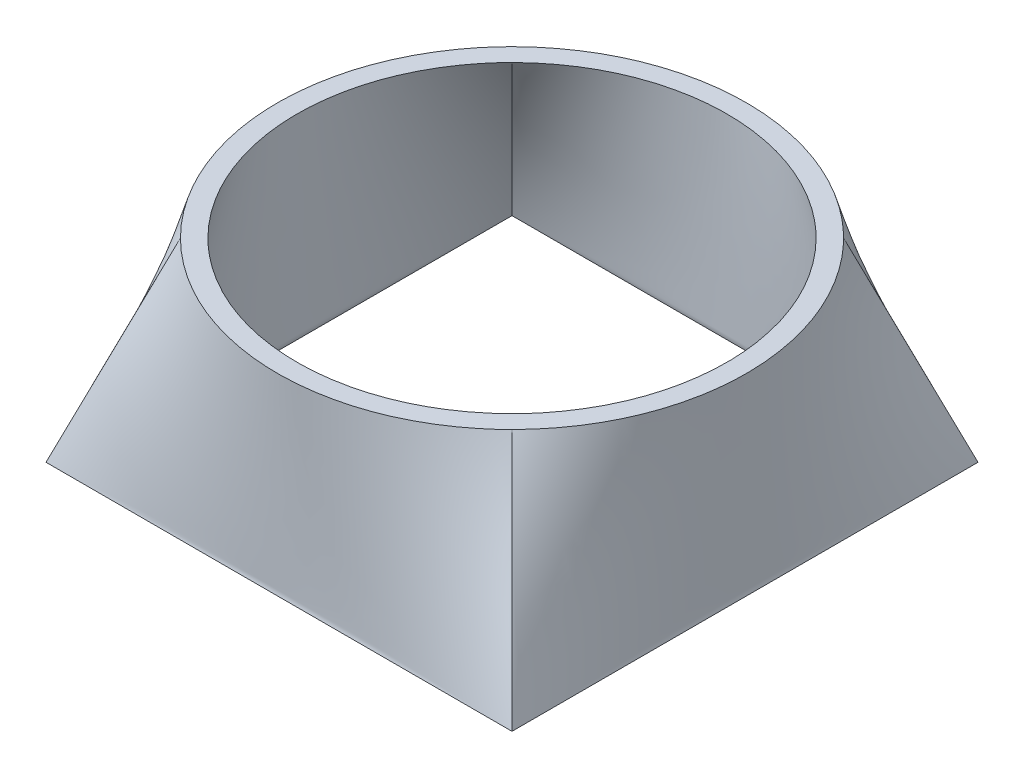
ISO-10303-21;
HEADER;
FILE_DESCRIPTION(('STEP AP214'),'2;1');
FILE_NAME('part.step','',(''),(''),'','','');
FILE_SCHEMA(('AUTOMOTIVE_DESIGN { 1 0 10303 214 1 1 1 1 }'));
ENDSEC;
DATA;
#1=APPLICATION_CONTEXT('core data for automotive mechanical design processes');
#2=APPLICATION_PROTOCOL_DEFINITION('international standard','automotive_design',2000,#1);
#3=PRODUCT_CONTEXT('',#1,'mechanical');
#4=PRODUCT('Part','Part','',(#3));
#5=PRODUCT_RELATED_PRODUCT_CATEGORY('part','',(#4));
#6=PRODUCT_DEFINITION_FORMATION('','',#4);
#7=PRODUCT_DEFINITION_CONTEXT('part definition',#1,'design');
#8=PRODUCT_DEFINITION('design','',#6,#7);
#9=PRODUCT_DEFINITION_SHAPE('','',#8);
#10=(LENGTH_UNIT() NAMED_UNIT(*) SI_UNIT(.MILLI.,.METRE.));
#11=(NAMED_UNIT(*) PLANE_ANGLE_UNIT() SI_UNIT($,.RADIAN.));
#12=(NAMED_UNIT(*) SI_UNIT($,.STERADIAN.) SOLID_ANGLE_UNIT());
#13=UNCERTAINTY_MEASURE_WITH_UNIT(LENGTH_MEASURE(1.E-05),#10,'distance_accuracy_value','');
#14=(GEOMETRIC_REPRESENTATION_CONTEXT(3) GLOBAL_UNCERTAINTY_ASSIGNED_CONTEXT((#13)) GLOBAL_UNIT_ASSIGNED_CONTEXT((#10,
#11,#12)) REPRESENTATION_CONTEXT('',''));
#15=CARTESIAN_POINT('',(0.,0.,0.));
#16=DIRECTION('',(0.,0.,1.));
#17=DIRECTION('',(1.,0.,0.));
#18=AXIS2_PLACEMENT_3D('',#15,#16,#17);
#19=CARTESIAN_POINT('',(24.14936374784,-0.4,25.10710815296));
#20=CARTESIAN_POINT('',(21.56039211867,6.533333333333,22.55723350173));
#21=CARTESIAN_POINT('',(18.97142048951,13.46666666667,20.0073588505));
#22=CARTESIAN_POINT('',(16.38244886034,20.4,17.45748419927));
#23=CARTESIAN_POINT('',(24.14567665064,-0.4,24.78417056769));
#24=CARTESIAN_POINT('',(21.62061470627,6.533333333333,22.28521406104));
#25=CARTESIAN_POINT('',(19.09555276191,13.46666666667,19.78625755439));
#26=CARTESIAN_POINT('',(16.57049081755,20.4,17.28730104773));
#27=CARTESIAN_POINT('',(24.09663015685,-0.4,20.42529096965));
#28=CARTESIAN_POINT('',(22.42170743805,6.533333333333,18.60024749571));
#29=CARTESIAN_POINT('',(20.74678471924,13.46666666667,16.77520402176));
#30=CARTESIAN_POINT('',(19.07186200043,20.4,14.95016054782));
#31=CARTESIAN_POINT('',(24.02214961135,-0.4,12.05034764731));
#32=CARTESIAN_POINT('',(23.63822301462,6.533333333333,11.17765509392));
#33=CARTESIAN_POINT('',(23.25429641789,13.46666666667,10.30496254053));
#34=CARTESIAN_POINT('',(22.87036982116,20.4,9.432269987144));
#35=CARTESIAN_POINT('',(23.98442519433,-0.4,0.));
#36=CARTESIAN_POINT('',(24.25438849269,6.533333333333,0.));
#37=CARTESIAN_POINT('',(24.52435179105,13.46666666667,0.));
#38=CARTESIAN_POINT('',(24.79431508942,20.4,0.));
#39=CARTESIAN_POINT('',(24.02214961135,-0.4,-12.05034764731));
#40=CARTESIAN_POINT('',(23.63822301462,6.533333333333,-11.17765509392));
#41=CARTESIAN_POINT('',(23.25429641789,13.46666666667,-10.30496254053));
#42=CARTESIAN_POINT('',(22.87036982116,20.4,-9.432269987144));
#43=CARTESIAN_POINT('',(24.09663015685,-0.4,-20.42529096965));
#44=CARTESIAN_POINT('',(22.42170743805,6.533333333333,-18.60024749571));
#45=CARTESIAN_POINT('',(20.74678471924,13.46666666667,-16.77520402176));
#46=CARTESIAN_POINT('',(19.07186200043,20.4,-14.95016054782));
#47=CARTESIAN_POINT('',(24.14567665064,-0.4,-24.78417056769));
#48=CARTESIAN_POINT('',(21.62061470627,6.533333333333,-22.28521406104));
#49=CARTESIAN_POINT('',(19.09555276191,13.46666666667,-19.78625755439));
#50=CARTESIAN_POINT('',(16.57049081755,20.4,-17.28730104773));
#51=CARTESIAN_POINT('',(24.14936374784,-0.4,-25.10710815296));
#52=CARTESIAN_POINT('',(21.56039211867,6.533333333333,-22.55723350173));
#53=CARTESIAN_POINT('',(18.97142048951,13.46666666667,-20.0073588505));
#54=CARTESIAN_POINT('',(16.38244886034,20.4,-17.45748419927));
#55=B_SPLINE_SURFACE_WITH_KNOTS('',3,3,((#19,#20,#21,#22),(#23,#24,#25,#26),(#27,#28,#29,#30),
(#31,#32,#33,#34),(#35,#36,#37,#38),(#39,#40,#41,#42),(#43,#44,#45,#46),(#47,#48,#49,#50),(#51,
#52,#53,#54)),.UNSPECIFIED.,.F.,.F.,.F.,(4,1,1,1,1,1,4),(4,4),(-0.02,0.,0.25,0.5,0.75,1.,1.02),
(-0.02,1.02),.UNSPECIFIED.);
#56=DIRECTION('',(-0.310910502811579,0.898147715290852,-0.310910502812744));
#57=VECTOR('',#56,1.);
#58=CARTESIAN_POINT('',(20.5383143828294,10.0000000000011,20.5383143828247));
#59=LINE('',#58,#57);
#60=CARTESIAN_POINT('',(23.9999999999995,5.90962464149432E-13,24.0000000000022));
#61=VERTEX_POINT('',#60);
#62=CARTESIAN_POINT('',(17.0766287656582,20.,17.0766287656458));
#63=VERTEX_POINT('',#62);
#64=EDGE_CURVE('E93',#61,#63,#59,.T.);
#65=DIRECTION('',(0.,0.,1.));
#66=VECTOR('',#65,1.);
#67=CARTESIAN_POINT('',(24.,0.,0.));
#68=LINE('',#67,#66);
#69=CARTESIAN_POINT('',(24.0000000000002,1.01003596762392E-12,-24.0000000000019));
#70=VERTEX_POINT('',#69);
#71=EDGE_CURVE('E117',#61,#70,#68,.F.);
#72=DIRECTION('',(0.310910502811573,-0.898147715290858,-0.310910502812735));
#73=VECTOR('',#72,1.);
#74=CARTESIAN_POINT('',(20.5383143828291,10.0000000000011,-20.5383143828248));
#75=LINE('',#74,#73);
#76=CARTESIAN_POINT('',(17.0766287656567,20.,-17.0766287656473));
#77=VERTEX_POINT('',#76);
#78=EDGE_CURVE('E131',#77,#70,#75,.T.);
#79=CARTESIAN_POINT('',(17.0766287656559,20.,17.0766287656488));
#80=CARTESIAN_POINT('',(17.4138269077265,20.,16.7393676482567));
#81=CARTESIAN_POINT('',(17.7409018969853,20.,16.3920076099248));
#82=CARTESIAN_POINT('',(18.3739003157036,20.,15.6784542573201));
#83=CARTESIAN_POINT('',(18.6798215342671,20.,15.3122589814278));
#84=CARTESIAN_POINT('',(19.2695591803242,20.,14.5624417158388));
#85=CARTESIAN_POINT('',(19.5533738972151,20.,14.1788183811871));
#86=CARTESIAN_POINT('',(20.0975929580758,20.,13.3960648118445));
#87=CARTESIAN_POINT('',(20.3580278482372,20.,12.9969558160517));
#88=CARTESIAN_POINT('',(20.8549710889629,20.,12.1841488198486));
#89=CARTESIAN_POINT('',(21.0914809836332,20.,11.7704517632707));
#90=CARTESIAN_POINT('',(21.5396497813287,20.,10.9298428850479));
#91=CARTESIAN_POINT('',(21.7513112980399,20.,10.5029324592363));
#92=CARTESIAN_POINT('',(22.0919638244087,20.,9.76114390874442));
#93=CARTESIAN_POINT('',(22.2272819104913,20.,9.44915657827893));
#94=CARTESIAN_POINT('',(22.4844541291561,20.,8.81967544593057));
#95=CARTESIAN_POINT('',(22.6063074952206,20.,8.50218133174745));
#96=CARTESIAN_POINT('',(22.9514787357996,20.,7.54240180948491));
#97=CARTESIAN_POINT('',(23.1544735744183,20.,6.8926756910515));
#98=CARTESIAN_POINT('',(23.5051187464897,20.,5.57876595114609));
#99=CARTESIAN_POINT('',(23.6527852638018,20.,4.91458661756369));
#100=CARTESIAN_POINT('',(23.8919733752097,20.,3.57618216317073));
#101=CARTESIAN_POINT('',(23.9834960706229,20.,2.90195723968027));
#102=CARTESIAN_POINT('',(24.1093926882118,20.,1.54885608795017));
#103=CARTESIAN_POINT('',(24.1438235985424,20.,0.869985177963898));
#104=CARTESIAN_POINT('',(24.154648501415,20.,-0.488215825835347));
#105=CARTESIAN_POINT('',(24.1310430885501,20.,-1.16754591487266));
#106=CARTESIAN_POINT('',(24.0266206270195,20.,-2.52191657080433));
#107=CARTESIAN_POINT('',(23.945791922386,20.,-3.19695623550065));
#108=CARTESIAN_POINT('',(23.7279168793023,20.,-4.53789425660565));
#109=CARTESIAN_POINT('',(23.5908688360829,20.,-5.20379233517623));
#110=CARTESIAN_POINT('',(23.2615466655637,20.,-6.52137246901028));
#111=CARTESIAN_POINT('',(23.0693129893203,20.,-7.17306456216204));
#112=CARTESIAN_POINT('',(22.7402965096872,20.,-8.13654416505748));
#113=CARTESIAN_POINT('',(22.6238312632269,20.,-8.45539610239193));
#114=CARTESIAN_POINT('',(22.3774279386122,20.,-9.08785054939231));
#115=CARTESIAN_POINT('',(22.2474898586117,20.,-9.40145305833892));
#116=CARTESIAN_POINT('',(21.8379908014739,20.,-10.3331309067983));
#117=CARTESIAN_POINT('',(21.5385612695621,20.,-10.9426145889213));
#118=CARTESIAN_POINT('',(20.8897779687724,20.,-12.1340309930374));
#119=CARTESIAN_POINT('',(20.5404347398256,20.,-12.7159694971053));
#120=CARTESIAN_POINT('',(19.7175213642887,20.,-13.9652282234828));
#121=CARTESIAN_POINT('',(19.2331744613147,20.,-14.6255267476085));
#122=CARTESIAN_POINT('',(18.4591544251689,20.,-15.575910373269));
#123=CARTESIAN_POINT('',(18.1934390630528,20.,-15.8858192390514));
#124=CARTESIAN_POINT('',(17.6465160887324,20.,-16.4918093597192));
#125=CARTESIAN_POINT('',(17.3653040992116,20.,-16.7878866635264));
#126=CARTESIAN_POINT('',(17.0766287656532,20.,-17.0766287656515));
#127=B_SPLINE_CURVE_WITH_KNOTS('',3,(#79,#80,#81,#82,#83,#84,#85,#86,#87,#88,#89,#90,#91,#92,
#93,#94,#95,#96,#97,#98,#99,#100,#101,#102,#103,#104,#105,#106,#107,#108,#109,#110,#111,#112,
#113,#114,#115,#116,#117,#118,#119,#120,#121,#122,#123,#124,#125,#126),.UNSPECIFIED.,.F.,.F.,(4,
2,2,2,2,2,2,2,2,2,2,2,2,2,2,2,2,2,2,2,2,2,2,4),(0.,1.43050783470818,2.86116495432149,
4.29193266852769,5.72080299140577,7.14958103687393,8.57820866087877,9.59811405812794,
10.6180774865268,12.6575321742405,14.6963898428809,16.7352075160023,18.7719888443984,
20.8087493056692,22.8459247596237,24.8831619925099,26.9189097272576,27.9370132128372,
28.9551168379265,30.9896240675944,33.0237023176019,35.4756808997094,36.6999122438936,
37.9244911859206),.UNSPECIFIED.);
#128=EDGE_CURVE('E96',#63,#77,#127,.T.);
#129=ORIENTED_EDGE('',*,*,#64,.F.);
#130=ORIENTED_EDGE('',*,*,#71,.T.);
#131=ORIENTED_EDGE('',*,*,#78,.F.);
#132=ORIENTED_EDGE('',*,*,#128,.F.);
#133=EDGE_LOOP('',(#129,#130,#131,#132));
#134=FACE_BOUND('',#133,.T.);
#135=ADVANCED_FACE('F16',(#134),#55,.T.);
#136=CARTESIAN_POINT('',(15.02597276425,20.4,-16.01198819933));
#137=CARTESIAN_POINT('',(17.39623038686,13.46666666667,-18.34621443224));
#138=CARTESIAN_POINT('',(19.76648800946,6.533333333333,-20.68044066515));
#139=CARTESIAN_POINT('',(22.13674563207,-0.4,-23.01466689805));
#140=CARTESIAN_POINT('',(15.19844188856,20.4,-15.85589557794));
#141=CARTESIAN_POINT('',(17.51008255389,13.46666666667,-18.14347790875));
#142=CARTESIAN_POINT('',(19.82172321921,6.533333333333,-20.43106023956));
#143=CARTESIAN_POINT('',(22.13336388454,-0.4,-22.71864257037));
#144=CARTESIAN_POINT('',(17.49266017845,20.4,-13.71226236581));
#145=CARTESIAN_POINT('',(19.02456652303,13.46666666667,-15.38251742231));
#146=CARTESIAN_POINT('',(20.55647286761,6.533333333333,-17.05277247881));
#147=CARTESIAN_POINT('',(22.08837921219,-0.4,-18.72302753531));
#148=CARTESIAN_POINT('',(20.97659178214,20.4,-8.651253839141));
#149=CARTESIAN_POINT('',(21.32441679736,13.46666666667,-9.449520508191));
#150=CARTESIAN_POINT('',(21.67224181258,6.533333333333,-10.24778717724));
#151=CARTESIAN_POINT('',(22.0200668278,-0.4,-11.04605384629));
#152=CARTESIAN_POINT('',(22.74120410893,20.4,0.));
#153=CARTESIAN_POINT('',(22.48929160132,13.46666666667,0.));
#154=CARTESIAN_POINT('',(22.23737909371,6.533333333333,0.));
#155=CARTESIAN_POINT('',(21.9854665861,-0.4,0.));
#156=CARTESIAN_POINT('',(20.97659178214,20.4,8.651253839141));
#157=CARTESIAN_POINT('',(21.32441679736,13.46666666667,9.449520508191));
#158=CARTESIAN_POINT('',(21.67224181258,6.533333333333,10.24778717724));
#159=CARTESIAN_POINT('',(22.0200668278,-0.4,11.04605384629));
#160=CARTESIAN_POINT('',(17.49266017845,20.4,13.71226236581));
#161=CARTESIAN_POINT('',(19.02456652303,13.46666666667,15.38251742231));
#162=CARTESIAN_POINT('',(20.55647286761,6.533333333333,17.05277247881));
#163=CARTESIAN_POINT('',(22.08837921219,-0.4,18.72302753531));
#164=CARTESIAN_POINT('',(15.19844188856,20.4,15.85589557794));
#165=CARTESIAN_POINT('',(17.51008255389,13.46666666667,18.14347790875));
#166=CARTESIAN_POINT('',(19.82172321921,6.533333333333,20.43106023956));
#167=CARTESIAN_POINT('',(22.13336388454,-0.4,22.71864257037));
#168=CARTESIAN_POINT('',(15.02597276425,20.4,16.01198819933));
#169=CARTESIAN_POINT('',(17.39623038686,13.46666666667,18.34621443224));
#170=CARTESIAN_POINT('',(19.76648800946,6.533333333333,20.68044066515));
#171=CARTESIAN_POINT('',(22.13674563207,-0.4,23.01466689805));
#172=B_SPLINE_SURFACE_WITH_KNOTS('',3,3,((#136,#137,#138,#139),(#140,#141,#142,#143),(#144,#145,
#146,#147),(#148,#149,#150,#151),(#152,#153,#154,#155),(#156,#157,#158,#159),(#160,#161,#162,
#163),(#164,#165,#166,#167),(#168,#169,#170,#171)),.UNSPECIFIED.,.F.,.F.,.F.,(4,1,1,1,1,1,4),(4,
4),(-0.02,0.,0.25,0.5,0.75,1.,1.02),(-0.02,1.02),.UNSPECIFIED.);
#173=CARTESIAN_POINT('',(15.662415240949,20.,-15.6624151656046));
#174=CARTESIAN_POINT('',(15.9687761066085,20.,-15.3559970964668));
#175=CARTESIAN_POINT('',(16.266026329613,20.,-15.0404898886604));
#176=CARTESIAN_POINT('',(16.8414952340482,20.,-14.3925173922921));
#177=CARTESIAN_POINT('',(17.1197121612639,20.,-14.0600505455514));
#178=CARTESIAN_POINT('',(17.6562665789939,20.,-13.3794116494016));
#179=CARTESIAN_POINT('',(17.9146026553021,20.,-13.0312384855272));
#180=CARTESIAN_POINT('',(18.4102509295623,20.,-12.3208695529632));
#181=CARTESIAN_POINT('',(18.6475884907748,20.,-11.9586914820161));
#182=CARTESIAN_POINT('',(19.100759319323,20.,-11.2211544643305));
#183=CARTESIAN_POINT('',(19.3165938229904,20.,-10.8457962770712));
#184=CARTESIAN_POINT('',(19.725933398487,20.,-10.083122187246));
#185=CARTESIAN_POINT('',(19.9194405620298,20.,-9.69580740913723));
#186=CARTESIAN_POINT('',(20.2324609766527,20.,-9.02017482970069));
#187=CARTESIAN_POINT('',(20.357544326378,20.,-8.73442514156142));
#188=CARTESIAN_POINT('',(20.5953756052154,20.,-8.15783228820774));
#189=CARTESIAN_POINT('',(20.7081228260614,20.,-7.86698883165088));
#190=CARTESIAN_POINT('',(21.0276732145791,20.,-6.98769662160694));
#191=CARTESIAN_POINT('',(21.2158453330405,20.,-6.39235587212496));
#192=CARTESIAN_POINT('',(21.5414571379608,20.,-5.18823382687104));
#193=CARTESIAN_POINT('',(21.6789109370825,20.,-4.57945631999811));
#194=CARTESIAN_POINT('',(21.9023467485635,20.,-3.35251539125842));
#195=CARTESIAN_POINT('',(21.9883296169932,20.,-2.73435212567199));
#196=CARTESIAN_POINT('',(22.1078996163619,20.,-1.49368713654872));
#197=CARTESIAN_POINT('',(22.1415472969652,20.,-0.871191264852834));
#198=CARTESIAN_POINT('',(22.1556323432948,20.,0.374397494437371));
#199=CARTESIAN_POINT('',(22.1360705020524,20.,0.997490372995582));
#200=CARTESIAN_POINT('',(22.0444350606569,20.,2.23990797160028));
#201=CARTESIAN_POINT('',(21.9723513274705,20.,2.85923194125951));
#202=CARTESIAN_POINT('',(21.77659942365,20.,4.08966866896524));
#203=CARTESIAN_POINT('',(21.6529294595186,20.,4.70078114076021));
#204=CARTESIAN_POINT('',(21.3549070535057,20.,5.91015405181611));
#205=CARTESIAN_POINT('',(21.1805904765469,20.,6.50842326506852));
#206=CARTESIAN_POINT('',(20.8817956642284,20.,7.39306315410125));
#207=CARTESIAN_POINT('',(20.7759636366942,20.,7.68584746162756));
#208=CARTESIAN_POINT('',(20.5519368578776,20.,8.26664705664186));
#209=CARTESIAN_POINT('',(20.4337421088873,20.,8.55466234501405));
#210=CARTESIAN_POINT('',(20.0610586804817,20.,9.41040668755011));
#211=CARTESIAN_POINT('',(19.7883091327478,20.,9.97031302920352));
#212=CARTESIAN_POINT('',(19.1969254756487,20.,11.0650037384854));
#213=CARTESIAN_POINT('',(18.8783006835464,20.,11.5997931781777));
#214=CARTESIAN_POINT('',(18.1205986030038,20.,12.7584188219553));
#215=CARTESIAN_POINT('',(17.6705573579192,20.,13.375167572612));
#216=CARTESIAN_POINT('',(16.9504186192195,20.,14.2624140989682));
#217=CARTESIAN_POINT('',(16.7030482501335,20.,14.5516611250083));
#218=CARTESIAN_POINT('',(16.1936177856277,20.,15.1170628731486));
#219=CARTESIAN_POINT('',(15.9315535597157,20.,15.3932138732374));
#220=CARTESIAN_POINT('',(15.662415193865,20.,15.6624152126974));
#221=B_SPLINE_CURVE_WITH_KNOTS('',3,(#173,#174,#175,#176,#177,#178,#179,#180,#181,#182,#183,
#184,#185,#186,#187,#188,#189,#190,#191,#192,#193,#194,#195,#196,#197,#198,#199,#200,#201,#202,
#203,#204,#205,#206,#207,#208,#209,#210,#211,#212,#213,#214,#215,#216,#217,#218,#219,#220),
.UNSPECIFIED.,.F.,.F.,(4,2,2,2,2,2,2,2,2,2,2,2,2,2,2,2,2,2,2,2,2,2,2,4),(0.,1.29968983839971,
2.59949930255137,3.89940114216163,5.19771081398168,6.49594579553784,7.79405905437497,
8.72956362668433,9.66512188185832,11.5358095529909,13.4059763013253,15.2761119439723,
17.1440823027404,19.0120248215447,20.8803278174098,22.7486957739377,24.6157438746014,
25.5494744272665,26.4832048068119,28.3491543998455,30.2147255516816,32.5006556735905,
33.6420256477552,34.7837180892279),.UNSPECIFIED.);
#222=CARTESIAN_POINT('',(15.6624152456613,20.,-15.6624151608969));
#223=VERTEX_POINT('',#222);
#224=CARTESIAN_POINT('',(15.6624151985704,20.,15.662415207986));
#225=VERTEX_POINT('',#224);
#226=EDGE_CURVE('E183',#223,#225,#221,.T.);
#227=DIRECTION('',(0.289170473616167,-0.912557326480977,-0.289170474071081));
#228=VECTOR('',#227,1.);
#229=CARTESIAN_POINT('',(18.8312076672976,10.0000000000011,-18.8312075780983));
#230=LINE('',#229,#228);
#231=CARTESIAN_POINT('',(22.0000000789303,1.67001482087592E-08,-21.9999999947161));
#232=VERTEX_POINT('',#231);
#233=EDGE_CURVE('E123',#223,#232,#230,.T.);
#234=DIRECTION('',(0.,0.,1.));
#235=VECTOR('',#234,1.);
#236=CARTESIAN_POINT('',(22.,0.,0.));
#237=LINE('',#236,#235);
#238=CARTESIAN_POINT('',(22.000000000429,-1.24334859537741E-09,22.0000000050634));
#239=VERTEX_POINT('',#238);
#240=EDGE_CURVE('E128',#232,#239,#237,.T.);
#241=DIRECTION('',(-0.289170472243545,0.912557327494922,-0.289170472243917));
#242=VECTOR('',#241,1.);
#243=CARTESIAN_POINT('',(18.8312076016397,10.0000000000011,18.8312076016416));
#244=LINE('',#243,#242);
#245=EDGE_CURVE('E142',#239,#225,#244,.T.);
#246=ORIENTED_EDGE('',*,*,#226,.F.);
#247=ORIENTED_EDGE('',*,*,#233,.T.);
#248=ORIENTED_EDGE('',*,*,#240,.T.);
#249=ORIENTED_EDGE('',*,*,#245,.T.);
#250=EDGE_LOOP('',(#246,#247,#248,#249));
#251=FACE_BOUND('',#250,.T.);
#252=ADVANCED_FACE('F240',(#251),#172,.F.);
#253=CARTESIAN_POINT('',(16.01198819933,20.4,15.02597276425));
#254=CARTESIAN_POINT('',(18.34621443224,13.46666666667,17.39623038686));
#255=CARTESIAN_POINT('',(20.68044066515,6.533333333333,19.76648800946));
#256=CARTESIAN_POINT('',(23.01466689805,-0.4,22.13674563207));
#257=CARTESIAN_POINT('',(15.85589557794,20.4,15.19844188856));
#258=CARTESIAN_POINT('',(18.14347790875,13.46666666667,17.51008255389));
#259=CARTESIAN_POINT('',(20.43106023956,6.533333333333,19.82172321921));
#260=CARTESIAN_POINT('',(22.71864257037,-0.4,22.13336388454));
#261=CARTESIAN_POINT('',(13.71226236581,20.4,17.49266017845));
#262=CARTESIAN_POINT('',(15.38251742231,13.46666666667,19.02456652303));
#263=CARTESIAN_POINT('',(17.05277247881,6.533333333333,20.55647286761));
#264=CARTESIAN_POINT('',(18.72302753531,-0.4,22.08837921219));
#265=CARTESIAN_POINT('',(8.651253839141,20.4,20.97659178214));
#266=CARTESIAN_POINT('',(9.449520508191,13.46666666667,21.32441679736));
#267=CARTESIAN_POINT('',(10.24778717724,6.533333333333,21.67224181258));
#268=CARTESIAN_POINT('',(11.04605384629,-0.4,22.0200668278));
#269=CARTESIAN_POINT('',(0.,20.4,22.74120410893));
#270=CARTESIAN_POINT('',(0.,13.46666666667,22.48929160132));
#271=CARTESIAN_POINT('',(0.,6.533333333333,22.23737909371));
#272=CARTESIAN_POINT('',(0.,-0.4,21.9854665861));
#273=CARTESIAN_POINT('',(-8.651253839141,20.4,20.97659178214));
#274=CARTESIAN_POINT('',(-9.449520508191,13.46666666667,21.32441679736));
#275=CARTESIAN_POINT('',(-10.24778717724,6.533333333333,21.67224181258));
#276=CARTESIAN_POINT('',(-11.04605384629,-0.4,22.0200668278));
#277=CARTESIAN_POINT('',(-13.71226236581,20.4,17.49266017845));
#278=CARTESIAN_POINT('',(-15.38251742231,13.46666666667,19.02456652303));
#279=CARTESIAN_POINT('',(-17.05277247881,6.533333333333,20.55647286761));
#280=CARTESIAN_POINT('',(-18.72302753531,-0.4,22.08837921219));
#281=CARTESIAN_POINT('',(-15.85589557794,20.4,15.19844188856));
#282=CARTESIAN_POINT('',(-18.14347790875,13.46666666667,17.51008255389));
#283=CARTESIAN_POINT('',(-20.43106023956,6.533333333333,19.82172321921));
#284=CARTESIAN_POINT('',(-22.71864257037,-0.4,22.13336388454));
#285=CARTESIAN_POINT('',(-16.01198819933,20.4,15.02597276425));
#286=CARTESIAN_POINT('',(-18.34621443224,13.46666666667,17.39623038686));
#287=CARTESIAN_POINT('',(-20.68044066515,6.533333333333,19.76648800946));
#288=CARTESIAN_POINT('',(-23.01466689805,-0.4,22.13674563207));
#289=B_SPLINE_SURFACE_WITH_KNOTS('',3,3,((#253,#254,#255,#256),(#257,#258,#259,#260),(#261,#262,
#263,#264),(#265,#266,#267,#268),(#269,#270,#271,#272),(#273,#274,#275,#276),(#277,#278,#279,
#280),(#281,#282,#283,#284),(#285,#286,#287,#288)),.UNSPECIFIED.,.F.,.F.,.F.,(4,1,1,1,1,1,4),(4,
4),(-0.02,0.,0.25,0.5,0.75,1.,1.02),(-0.02,1.02),.UNSPECIFIED.);
#290=CARTESIAN_POINT('',(15.6624151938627,20.,15.6624152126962));
#291=CARTESIAN_POINT('',(15.3559971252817,20.,15.9687760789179));
#292=CARTESIAN_POINT('',(15.0404899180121,20.,16.2660263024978));
#293=CARTESIAN_POINT('',(14.3925174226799,20.,16.8414952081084));
#294=CARTESIAN_POINT('',(14.0600505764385,20.,17.1197121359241));
#295=CARTESIAN_POINT('',(13.3794116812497,20.,17.656266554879));
#296=CARTESIAN_POINT('',(13.0312385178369,20.,17.9146026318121));
#297=CARTESIAN_POINT('',(12.3208695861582,20.,18.4102509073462));
#298=CARTESIAN_POINT('',(11.958691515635,20.,18.6475884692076));
#299=CARTESIAN_POINT('',(11.221154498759,20.,19.1007592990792));
#300=CARTESIAN_POINT('',(10.8457963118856,20.,19.3165938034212));
#301=CARTESIAN_POINT('',(10.0831222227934,20.,19.7259333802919));
#302=CARTESIAN_POINT('',(9.69580744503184,20.,19.9194405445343));
#303=CARTESIAN_POINT('',(9.02017486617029,20.,20.2324609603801));
#304=CARTESIAN_POINT('',(8.73442517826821,20.,20.3575443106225));
#305=CARTESIAN_POINT('',(8.15783232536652,20.,20.5953755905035));
#306=CARTESIAN_POINT('',(7.86698886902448,20.,20.7081228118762));
#307=CARTESIAN_POINT('',(6.98769665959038,20.,21.0276732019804));
#308=CARTESIAN_POINT('',(6.39235591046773,20.,21.2158453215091));
#309=CARTESIAN_POINT('',(5.18823386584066,20.,21.541457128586));
#310=CARTESIAN_POINT('',(4.57945635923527,20.,21.6789109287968));
#311=CARTESIAN_POINT('',(3.35251543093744,20.,21.9023467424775));
#312=CARTESIAN_POINT('',(2.73435216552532,20.,21.9883296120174));
#313=CARTESIAN_POINT('',(1.49368717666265,20.,22.1078996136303));
#314=CARTESIAN_POINT('',(0.871191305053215,20.,22.141547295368));
#315=CARTESIAN_POINT('',(-0.374397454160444,20.,22.1556323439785));
#316=CARTESIAN_POINT('',(-0.997490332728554,20.,22.1360705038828));
#317=CARTESIAN_POINT('',(-2.23990793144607,20.,22.0444350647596));
#318=CARTESIAN_POINT('',(-2.85923190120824,20.,21.9723513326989));
#319=CARTESIAN_POINT('',(-4.08966862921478,20.,21.7765994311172));
#320=CARTESIAN_POINT('',(-4.70078110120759,20.,21.6529294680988));
#321=CARTESIAN_POINT('',(-5.91015401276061,20.,21.3549070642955));
#322=CARTESIAN_POINT('',(-6.50842322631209,20.,21.1805904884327));
#323=CARTESIAN_POINT('',(-7.39306311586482,20.,20.881795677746));
#324=CARTESIAN_POINT('',(-7.68584742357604,20.,20.7759636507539));
#325=CARTESIAN_POINT('',(-8.26664701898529,20.,20.5519368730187));
#326=CARTESIAN_POINT('',(-8.5546623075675,20.,20.4337421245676));
#327=CARTESIAN_POINT('',(-9.41040665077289,20.,20.0610586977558));
#328=CARTESIAN_POINT('',(-9.97031299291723,20.,19.7883091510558));
#329=CARTESIAN_POINT('',(-11.0650037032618,20.,19.1969254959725));
#330=CARTESIAN_POINT('',(-11.5997931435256,20.,18.8783007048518));
#331=CARTESIAN_POINT('',(-12.7584187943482,20.,18.1205986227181));
#332=CARTESIAN_POINT('',(-13.3751675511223,20.,17.6705573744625));
#333=CARTESIAN_POINT('',(-14.2624140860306,20.,16.9504186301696));
#334=CARTESIAN_POINT('',(-14.5516611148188,20.,16.7030482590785));
#335=CARTESIAN_POINT('',(-15.1170628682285,20.,16.1936177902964));
#336=CARTESIAN_POINT('',(-15.3932138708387,20.,15.9315535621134));
#337=CARTESIAN_POINT('',(-15.6624152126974,20.,15.662415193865));
#338=B_SPLINE_CURVE_WITH_KNOTS('',3,(#290,#291,#292,#293,#294,#295,#296,#297,#298,#299,#300,
#301,#302,#303,#304,#305,#306,#307,#308,#309,#310,#311,#312,#313,#314,#315,#316,#317,#318,#319,
#320,#321,#322,#323,#324,#325,#326,#327,#328,#329,#330,#331,#332,#333,#334,#335,#336,#337),
.UNSPECIFIED.,.F.,.F.,(4,2,2,2,2,2,2,2,2,2,2,2,2,2,2,2,2,2,2,2,2,2,2,4),(0.,1.29968983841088,
2.59949930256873,3.89940114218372,5.19771081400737,6.49594579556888,7.79405905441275,
8.72956362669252,9.6651218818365,11.5358095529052,13.4059763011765,15.2761119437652,
17.1440823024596,19.0120248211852,20.8803278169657,22.7486957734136,24.6157438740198,
25.549474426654,26.4832048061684,28.3491543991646,30.2147255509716,32.5006556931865,
33.6420256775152,34.7837181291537),.UNSPECIFIED.);
#339=CARTESIAN_POINT('',(-15.662415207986,20.,15.6624151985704));
#340=VERTEX_POINT('',#339);
#341=EDGE_CURVE('E202',#225,#340,#338,.T.);
#342=DIRECTION('',(1.,0.,0.));
#343=VECTOR('',#342,1.);
#344=CARTESIAN_POINT('',(0.,0.,22.));
#345=LINE('',#344,#343);
#346=CARTESIAN_POINT('',(-22.000000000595,-1.86502289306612E-09,22.0000000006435));
#347=VERTEX_POINT('',#346);
#348=EDGE_CURVE('E151',#239,#347,#345,.F.);
#349=DIRECTION('',(0.289170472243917,0.912557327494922,-0.289170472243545));
#350=VECTOR('',#349,1.);
#351=CARTESIAN_POINT('',(-18.8312076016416,10.0000000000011,18.8312076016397));
#352=LINE('',#351,#350);
#353=EDGE_CURVE('E135',#347,#340,#352,.T.);
#354=ORIENTED_EDGE('',*,*,#341,.F.);
#355=ORIENTED_EDGE('',*,*,#245,.F.);
#356=ORIENTED_EDGE('',*,*,#348,.T.);
#357=ORIENTED_EDGE('',*,*,#353,.T.);
#358=EDGE_LOOP('',(#354,#355,#356,#357));
#359=FACE_BOUND('',#358,.T.);
#360=ADVANCED_FACE('F243',(#359),#289,.F.);
#361=CARTESIAN_POINT('',(-15.02597276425,20.4,16.01198819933));
#362=CARTESIAN_POINT('',(-17.39623038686,13.46666666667,18.34621443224));
#363=CARTESIAN_POINT('',(-19.76648800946,6.533333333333,20.68044066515));
#364=CARTESIAN_POINT('',(-22.13674563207,-0.4,23.01466689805));
#365=CARTESIAN_POINT('',(-15.19844188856,20.4,15.85589557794));
#366=CARTESIAN_POINT('',(-17.51008255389,13.46666666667,18.14347790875));
#367=CARTESIAN_POINT('',(-19.82172321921,6.533333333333,20.43106023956));
#368=CARTESIAN_POINT('',(-22.13336388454,-0.4,22.71864257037));
#369=CARTESIAN_POINT('',(-17.49266017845,20.4,13.71226236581));
#370=CARTESIAN_POINT('',(-19.02456652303,13.46666666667,15.38251742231));
#371=CARTESIAN_POINT('',(-20.55647286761,6.533333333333,17.05277247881));
#372=CARTESIAN_POINT('',(-22.08837921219,-0.4,18.72302753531));
#373=CARTESIAN_POINT('',(-20.97659178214,20.4,8.651253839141));
#374=CARTESIAN_POINT('',(-21.32441679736,13.46666666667,9.449520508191));
#375=CARTESIAN_POINT('',(-21.67224181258,6.533333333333,10.24778717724));
#376=CARTESIAN_POINT('',(-22.0200668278,-0.4,11.04605384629));
#377=CARTESIAN_POINT('',(-22.74120410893,20.4,0.));
#378=CARTESIAN_POINT('',(-22.48929160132,13.46666666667,0.));
#379=CARTESIAN_POINT('',(-22.23737909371,6.533333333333,0.));
#380=CARTESIAN_POINT('',(-21.9854665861,-0.4,0.));
#381=CARTESIAN_POINT('',(-20.97659178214,20.4,-8.651253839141));
#382=CARTESIAN_POINT('',(-21.32441679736,13.46666666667,-9.449520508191));
#383=CARTESIAN_POINT('',(-21.67224181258,6.533333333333,-10.24778717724));
#384=CARTESIAN_POINT('',(-22.0200668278,-0.4,-11.04605384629));
#385=CARTESIAN_POINT('',(-17.49266017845,20.4,-13.71226236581));
#386=CARTESIAN_POINT('',(-19.02456652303,13.46666666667,-15.38251742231));
#387=CARTESIAN_POINT('',(-20.55647286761,6.533333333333,-17.05277247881));
#388=CARTESIAN_POINT('',(-22.08837921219,-0.4,-18.72302753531));
#389=CARTESIAN_POINT('',(-15.19844188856,20.4,-15.85589557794));
#390=CARTESIAN_POINT('',(-17.51008255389,13.46666666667,-18.14347790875));
#391=CARTESIAN_POINT('',(-19.82172321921,6.533333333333,-20.43106023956));
#392=CARTESIAN_POINT('',(-22.13336388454,-0.4,-22.71864257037));
#393=CARTESIAN_POINT('',(-15.02597276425,20.4,-16.01198819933));
#394=CARTESIAN_POINT('',(-17.39623038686,13.46666666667,-18.34621443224));
#395=CARTESIAN_POINT('',(-19.76648800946,6.533333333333,-20.68044066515));
#396=CARTESIAN_POINT('',(-22.13674563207,-0.4,-23.01466689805));
#397=B_SPLINE_SURFACE_WITH_KNOTS('',3,3,((#361,#362,#363,#364),(#365,#366,#367,#368),(#369,#370,
#371,#372),(#373,#374,#375,#376),(#377,#378,#379,#380),(#381,#382,#383,#384),(#385,#386,#387,
#388),(#389,#390,#391,#392),(#393,#394,#395,#396)),.UNSPECIFIED.,.F.,.F.,.F.,(4,1,1,1,1,1,4),(4,
4),(-0.02,0.,0.25,0.5,0.75,1.,1.02),(-0.02,1.02),.UNSPECIFIED.);
#398=CARTESIAN_POINT('',(-15.6624152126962,20.,15.6624151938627));
#399=CARTESIAN_POINT('',(-15.968776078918,20.,15.3559971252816));
#400=CARTESIAN_POINT('',(-16.266026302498,20.,15.0404899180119));
#401=CARTESIAN_POINT('',(-16.8414952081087,20.,14.3925174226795));
#402=CARTESIAN_POINT('',(-17.1197121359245,20.,14.060050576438));
#403=CARTESIAN_POINT('',(-17.6562665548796,20.,13.379411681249));
#404=CARTESIAN_POINT('',(-17.9146026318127,20.,13.0312385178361));
#405=CARTESIAN_POINT('',(-18.4102509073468,20.,12.3208695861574));
#406=CARTESIAN_POINT('',(-18.6475884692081,20.,11.9586915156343));
#407=CARTESIAN_POINT('',(-19.1007592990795,20.,11.2211544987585));
#408=CARTESIAN_POINT('',(-19.3165938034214,20.,10.8457963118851));
#409=CARTESIAN_POINT('',(-19.725933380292,20.,10.0831222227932));
#410=CARTESIAN_POINT('',(-19.9194405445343,20.,9.69580744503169));
#411=CARTESIAN_POINT('',(-20.2324609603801,20.,9.02017486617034));
#412=CARTESIAN_POINT('',(-20.3575443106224,20.,8.73442517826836));
#413=CARTESIAN_POINT('',(-20.5953755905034,20.,8.15783232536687));
#414=CARTESIAN_POINT('',(-20.708122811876,20.,7.86698886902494));
#415=CARTESIAN_POINT('',(-21.0276732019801,20.,6.98769665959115));
#416=CARTESIAN_POINT('',(-21.2158453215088,20.,6.39235591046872));
#417=CARTESIAN_POINT('',(-21.5414571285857,20.,5.18823386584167));
#418=CARTESIAN_POINT('',(-21.6789109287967,20.,4.57945635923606));
#419=CARTESIAN_POINT('',(-21.9023467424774,20.,3.35251543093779));
#420=CARTESIAN_POINT('',(-21.9883296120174,20.,2.73435216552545));
#421=CARTESIAN_POINT('',(-22.1078996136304,20.,1.49368717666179));
#422=CARTESIAN_POINT('',(-22.1415472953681,20.,0.871191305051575));
#423=CARTESIAN_POINT('',(-22.1556323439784,20.,-0.374397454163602));
#424=CARTESIAN_POINT('',(-22.1360705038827,20.,-0.997490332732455));
#425=CARTESIAN_POINT('',(-22.0444350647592,20.,-2.2399079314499));
#426=CARTESIAN_POINT('',(-21.9723513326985,20.,-2.85923190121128));
#427=CARTESIAN_POINT('',(-21.7765994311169,20.,-4.08966862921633));
#428=CARTESIAN_POINT('',(-21.6529294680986,20.,-4.70078110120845));
#429=CARTESIAN_POINT('',(-21.354907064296,20.,-5.91015401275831));
#430=CARTESIAN_POINT('',(-21.180590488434,20.,-6.50842322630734));
#431=CARTESIAN_POINT('',(-20.881795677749,20.,-7.39306311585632));
#432=CARTESIAN_POINT('',(-20.7759636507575,20.,-7.68584742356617));
#433=CARTESIAN_POINT('',(-20.5519368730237,20.,-8.26664701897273));
#434=CARTESIAN_POINT('',(-20.4337421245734,20.,-8.55466230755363));
#435=CARTESIAN_POINT('',(-20.061058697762,20.,-9.4104066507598));
#436=CARTESIAN_POINT('',(-19.7883091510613,20.,-9.97031299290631));
#437=CARTESIAN_POINT('',(-19.1969254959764,20.,-11.0650037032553));
#438=CARTESIAN_POINT('',(-18.8783007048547,20.,-11.5997931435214));
#439=CARTESIAN_POINT('',(-18.1205986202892,20.,-12.758418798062));
#440=CARTESIAN_POINT('',(-17.67055736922,20.,-13.3751675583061));
#441=CARTESIAN_POINT('',(-16.9504186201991,20.,-14.2624140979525));
#442=CARTESIAN_POINT('',(-16.7030482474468,20.,-14.5516611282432));
#443=CARTESIAN_POINT('',(-16.1936177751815,20.,-15.1170628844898));
#444=CARTESIAN_POINT('',(-15.9315535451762,20.,-15.3932138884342));
#445=CARTESIAN_POINT('',(-15.6624151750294,20.,-15.6624152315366));
#446=B_SPLINE_CURVE_WITH_KNOTS('',3,(#398,#399,#400,#401,#402,#403,#404,#405,#406,#407,#408,
#409,#410,#411,#412,#413,#414,#415,#416,#417,#418,#419,#420,#421,#422,#423,#424,#425,#426,#427,
#428,#429,#430,#431,#432,#433,#434,#435,#436,#437,#438,#439,#440,#441,#442,#443,#444,#445),
.UNSPECIFIED.,.F.,.F.,(4,2,2,2,2,2,2,2,2,2,2,2,2,2,2,2,2,2,2,2,2,2,2,4),(0.,1.29968983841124,
2.59949930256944,3.89940114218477,5.19771081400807,6.49594579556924,7.79405905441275,
8.72956362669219,9.66512188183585,11.5358095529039,13.4059763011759,15.2761119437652,
17.144082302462,19.0120248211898,20.8803278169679,22.7486957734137,24.6157438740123,
25.5494744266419,26.4832048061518,28.3491543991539,30.2147255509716,32.5006557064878,
33.6420256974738,34.7837181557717),.UNSPECIFIED.);
#447=CARTESIAN_POINT('',(-15.6624151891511,20.,-15.6624152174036));
#448=VERTEX_POINT('',#447);
#449=EDGE_CURVE('E196',#340,#448,#446,.T.);
#450=DIRECTION('',(0.,0.,1.));
#451=VECTOR('',#450,1.);
#452=CARTESIAN_POINT('',(-22.,0.,0.));
#453=LINE('',#452,#451);
#454=CARTESIAN_POINT('',(-22.0000000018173,-5.56925946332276E-09,-22.0000000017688));
#455=VERTEX_POINT('',#454);
#456=EDGE_CURVE('E108',#347,#455,#453,.F.);
#457=DIRECTION('',(0.289170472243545,0.912557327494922,0.289170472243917));
#458=VECTOR('',#457,1.);
#459=CARTESIAN_POINT('',(-18.8312076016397,10.0000000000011,-18.8312076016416));
#460=LINE('',#459,#458);
#461=EDGE_CURVE('E133',#455,#448,#460,.T.);
#462=ORIENTED_EDGE('',*,*,#449,.F.);
#463=ORIENTED_EDGE('',*,*,#353,.F.);
#464=ORIENTED_EDGE('',*,*,#456,.T.);
#465=ORIENTED_EDGE('',*,*,#461,.T.);
#466=EDGE_LOOP('',(#462,#463,#464,#465));
#467=FACE_BOUND('',#466,.T.);
#468=ADVANCED_FACE('F236',(#467),#397,.F.);
#469=CARTESIAN_POINT('',(-16.01198819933,20.4,-15.02597276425));
#470=CARTESIAN_POINT('',(-18.34621443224,13.46666666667,-17.39623038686));
#471=CARTESIAN_POINT('',(-20.68044066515,6.533333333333,-19.76648800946));
#472=CARTESIAN_POINT('',(-23.01466689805,-0.4,-22.13674563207));
#473=CARTESIAN_POINT('',(-15.85589557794,20.4,-15.19844188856));
#474=CARTESIAN_POINT('',(-18.14347790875,13.46666666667,-17.51008255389));
#475=CARTESIAN_POINT('',(-20.43106023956,6.533333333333,-19.82172321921));
#476=CARTESIAN_POINT('',(-22.71864257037,-0.4,-22.13336388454));
#477=CARTESIAN_POINT('',(-13.71226236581,20.4,-17.49266017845));
#478=CARTESIAN_POINT('',(-15.38251742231,13.46666666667,-19.02456652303));
#479=CARTESIAN_POINT('',(-17.05277247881,6.533333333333,-20.55647286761));
#480=CARTESIAN_POINT('',(-18.72302753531,-0.4,-22.08837921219));
#481=CARTESIAN_POINT('',(-8.651253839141,20.4,-20.97659178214));
#482=CARTESIAN_POINT('',(-9.449520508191,13.46666666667,-21.32441679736));
#483=CARTESIAN_POINT('',(-10.24778717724,6.533333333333,-21.67224181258));
#484=CARTESIAN_POINT('',(-11.04605384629,-0.4,-22.0200668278));
#485=CARTESIAN_POINT('',(0.,20.4,-22.74120410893));
#486=CARTESIAN_POINT('',(0.,13.46666666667,-22.48929160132));
#487=CARTESIAN_POINT('',(0.,6.533333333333,-22.23737909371));
#488=CARTESIAN_POINT('',(0.,-0.4,-21.9854665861));
#489=CARTESIAN_POINT('',(8.651253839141,20.4,-20.97659178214));
#490=CARTESIAN_POINT('',(9.449520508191,13.46666666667,-21.32441679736));
#491=CARTESIAN_POINT('',(10.24778717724,6.533333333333,-21.67224181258));
#492=CARTESIAN_POINT('',(11.04605384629,-0.4,-22.0200668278));
#493=CARTESIAN_POINT('',(13.71226236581,20.4,-17.49266017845));
#494=CARTESIAN_POINT('',(15.38251742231,13.46666666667,-19.02456652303));
#495=CARTESIAN_POINT('',(17.05277247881,6.533333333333,-20.55647286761));
#496=CARTESIAN_POINT('',(18.72302753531,-0.4,-22.08837921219));
#497=CARTESIAN_POINT('',(15.85589557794,20.4,-15.19844188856));
#498=CARTESIAN_POINT('',(18.14347790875,13.46666666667,-17.51008255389));
#499=CARTESIAN_POINT('',(20.43106023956,6.533333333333,-19.82172321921));
#500=CARTESIAN_POINT('',(22.71864257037,-0.4,-22.13336388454));
#501=CARTESIAN_POINT('',(16.01198819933,20.4,-15.02597276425));
#502=CARTESIAN_POINT('',(18.34621443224,13.46666666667,-17.39623038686));
#503=CARTESIAN_POINT('',(20.68044066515,6.533333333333,-19.76648800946));
#504=CARTESIAN_POINT('',(23.01466689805,-0.4,-22.13674563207));
#505=B_SPLINE_SURFACE_WITH_KNOTS('',3,3,((#469,#470,#471,#472),(#473,#474,#475,#476),(#477,#478,
#479,#480),(#481,#482,#483,#484),(#485,#486,#487,#488),(#489,#490,#491,#492),(#493,#494,#495,
#496),(#497,#498,#499,#500),(#501,#502,#503,#504)),.UNSPECIFIED.,.F.,.F.,.F.,(4,1,1,1,1,1,4),(4,
4),(-0.02,0.,0.25,0.5,0.75,1.,1.02),(-0.02,1.02),.UNSPECIFIED.);
#506=CARTESIAN_POINT('',(-15.6624151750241,20.,-15.6624152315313));
#507=CARTESIAN_POINT('',(-15.3559971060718,20.,-15.9687760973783));
#508=CARTESIAN_POINT('',(-15.0404898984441,20.,-16.2660263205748));
#509=CARTESIAN_POINT('',(-14.3925174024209,20.,-16.841495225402));
#510=CARTESIAN_POINT('',(-14.0600505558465,20.,-17.1197121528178));
#511=CARTESIAN_POINT('',(-13.3794116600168,20.,-17.6562665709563));
#512=CARTESIAN_POINT('',(-13.0312384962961,20.,-17.9146026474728));
#513=CARTESIAN_POINT('',(-12.3208695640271,20.,-18.4102509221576));
#514=CARTESIAN_POINT('',(-11.9586914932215,20.,-18.6475884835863));
#515=CARTESIAN_POINT('',(-11.221154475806,20.,-19.1007593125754));
#516=CARTESIAN_POINT('',(-10.8457962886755,20.,-19.3165938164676));
#517=CARTESIAN_POINT('',(-10.083122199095,20.,-19.7259333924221));
#518=CARTESIAN_POINT('',(-9.69580742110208,20.,-19.919440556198));
#519=CARTESIAN_POINT('',(-9.02017484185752,20.,-20.2324609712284));
#520=CARTESIAN_POINT('',(-8.73442515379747,20.,-20.357544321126));
#521=CARTESIAN_POINT('',(-8.15783230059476,20.,-20.5953756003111));
#522=CARTESIAN_POINT('',(-7.86698884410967,20.,-20.7081228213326));
#523=CARTESIAN_POINT('',(-6.98769663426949,20.,-21.0276732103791));
#524=CARTESIAN_POINT('',(-6.39235588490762,20.,-21.2158453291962));
#525=CARTESIAN_POINT('',(-5.18823383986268,20.,-21.5414571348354));
#526=CARTESIAN_POINT('',(-4.57945633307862,20.,-21.6789109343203));
#527=CARTESIAN_POINT('',(-3.35251540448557,20.,-21.9023467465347));
#528=CARTESIAN_POINT('',(-2.73435213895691,20.,-21.9883296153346));
#529=CARTESIAN_POINT('',(-1.49368714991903,20.,-22.1078996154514));
#530=CARTESIAN_POINT('',(-0.871191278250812,20.,-22.141547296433));
#531=CARTESIAN_POINT('',(0.37439748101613,20.,-22.1556323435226));
#532=CARTESIAN_POINT('',(0.997490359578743,20.,-22.1360705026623));
#533=CARTESIAN_POINT('',(2.23990795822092,20.,-22.0444350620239));
#534=CARTESIAN_POINT('',(2.85923192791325,20.,-21.9723513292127));
#535=CARTESIAN_POINT('',(4.08966865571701,20.,-21.7765994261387));
#536=CARTESIAN_POINT('',(4.70078112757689,20.,-21.6529294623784));
#537=CARTESIAN_POINT('',(5.91015403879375,20.,-21.3549070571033));
#538=CARTESIAN_POINT('',(6.5084232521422,20.,-21.180590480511));
#539=CARTESIAN_POINT('',(7.39306314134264,20.,-20.8817956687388));
#540=CARTESIAN_POINT('',(7.68584744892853,20.,-20.7759636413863));
#541=CARTESIAN_POINT('',(8.26664704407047,20.,-20.5519368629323));
#542=CARTESIAN_POINT('',(8.5546623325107,20.,-20.4337421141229));
#543=CARTESIAN_POINT('',(9.41040667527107,20.,-20.0610586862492));
#544=CARTESIAN_POINT('',(9.97031301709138,20.,-19.7883091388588));
#545=CARTESIAN_POINT('',(11.0650037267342,20.,-19.1969254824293));
#546=CARTESIAN_POINT('',(11.5997931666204,20.,-18.8783006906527));
#547=CARTESIAN_POINT('',(12.7584188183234,20.,-18.120598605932));
#548=CARTESIAN_POINT('',(13.3751675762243,20.,-17.6705573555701));
#549=CARTESIAN_POINT('',(14.2624141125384,20.,-16.950418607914));
#550=CARTESIAN_POINT('',(14.5516611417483,20.,-16.7030482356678));
#551=CARTESIAN_POINT('',(15.1170628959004,20.,-16.1936177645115));
#552=CARTESIAN_POINT('',(15.393213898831,20.,-15.9315535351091));
#553=CARTESIAN_POINT('',(15.6624152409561,20.,-15.6624151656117));
#554=B_SPLINE_CURVE_WITH_KNOTS('',3,(#506,#507,#508,#509,#510,#511,#512,#513,#514,#515,#516,
#517,#518,#519,#520,#521,#522,#523,#524,#525,#526,#527,#528,#529,#530,#531,#532,#533,#534,#535,
#536,#537,#538,#539,#540,#541,#542,#543,#544,#545,#546,#547,#548,#549,#550,#551,#552,#553),
.UNSPECIFIED.,.F.,.F.,(4,2,2,2,2,2,2,2,2,2,2,2,2,2,2,2,2,2,2,2,2,2,2,4),(0.,1.29968983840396,
2.59949930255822,3.89940114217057,5.1977108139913,6.49594579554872,7.79405905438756,
8.72956362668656,9.66512188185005,11.5358095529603,13.4059763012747,15.2761119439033,
17.1440823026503,19.0120248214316,20.880327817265,22.748695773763,24.6157438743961,
25.5494744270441,26.4832048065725,28.3491543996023,30.2147255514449,32.5006557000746,
33.6420256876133,34.7837181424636),.UNSPECIFIED.);
#555=EDGE_CURVE('E189',#448,#223,#554,.T.);
#556=DIRECTION('',(1.,0.,0.));
#557=VECTOR('',#556,1.);
#558=CARTESIAN_POINT('',(0.,0.,-22.));
#559=LINE('',#558,#557);
#560=EDGE_CURVE('E105',#455,#232,#559,.T.);
#561=ORIENTED_EDGE('',*,*,#555,.F.);
#562=ORIENTED_EDGE('',*,*,#461,.F.);
#563=ORIENTED_EDGE('',*,*,#560,.T.);
#564=ORIENTED_EDGE('',*,*,#233,.F.);
#565=EDGE_LOOP('',(#561,#562,#563,#564));
#566=FACE_BOUND('',#565,.T.);
#567=ADVANCED_FACE('F238',(#566),#505,.F.);
#568=CARTESIAN_POINT('',(-25.10710815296,-0.4,24.14936374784));
#569=CARTESIAN_POINT('',(-22.55723350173,6.533333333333,21.56039211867));
#570=CARTESIAN_POINT('',(-20.0073588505,13.46666666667,18.97142048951));
#571=CARTESIAN_POINT('',(-17.45748419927,20.4,16.38244886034));
#572=CARTESIAN_POINT('',(-24.78417056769,-0.4,24.14567665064));
#573=CARTESIAN_POINT('',(-22.28521406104,6.533333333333,21.62061470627));
#574=CARTESIAN_POINT('',(-19.78625755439,13.46666666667,19.09555276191));
#575=CARTESIAN_POINT('',(-17.28730104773,20.4,16.57049081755));
#576=CARTESIAN_POINT('',(-20.42529096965,-0.4,24.09663015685));
#577=CARTESIAN_POINT('',(-18.60024749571,6.533333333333,22.42170743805));
#578=CARTESIAN_POINT('',(-16.77520402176,13.46666666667,20.74678471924));
#579=CARTESIAN_POINT('',(-14.95016054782,20.4,19.07186200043));
#580=CARTESIAN_POINT('',(-12.05034764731,-0.4,24.02214961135));
#581=CARTESIAN_POINT('',(-11.17765509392,6.533333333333,23.63822301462));
#582=CARTESIAN_POINT('',(-10.30496254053,13.46666666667,23.25429641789));
#583=CARTESIAN_POINT('',(-9.432269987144,20.4,22.87036982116));
#584=CARTESIAN_POINT('',(0.,-0.4,23.98442519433));
#585=CARTESIAN_POINT('',(0.,6.533333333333,24.25438849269));
#586=CARTESIAN_POINT('',(0.,13.46666666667,24.52435179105));
#587=CARTESIAN_POINT('',(0.,20.4,24.79431508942));
#588=CARTESIAN_POINT('',(12.05034764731,-0.4,24.02214961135));
#589=CARTESIAN_POINT('',(11.17765509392,6.533333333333,23.63822301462));
#590=CARTESIAN_POINT('',(10.30496254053,13.46666666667,23.25429641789));
#591=CARTESIAN_POINT('',(9.432269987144,20.4,22.87036982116));
#592=CARTESIAN_POINT('',(20.42529096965,-0.4,24.09663015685));
#593=CARTESIAN_POINT('',(18.60024749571,6.533333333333,22.42170743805));
#594=CARTESIAN_POINT('',(16.77520402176,13.46666666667,20.74678471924));
#595=CARTESIAN_POINT('',(14.95016054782,20.4,19.07186200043));
#596=CARTESIAN_POINT('',(24.78417056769,-0.4,24.14567665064));
#597=CARTESIAN_POINT('',(22.28521406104,6.533333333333,21.62061470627));
#598=CARTESIAN_POINT('',(19.78625755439,13.46666666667,19.09555276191));
#599=CARTESIAN_POINT('',(17.28730104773,20.4,16.57049081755));
#600=CARTESIAN_POINT('',(25.10710815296,-0.4,24.14936374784));
#601=CARTESIAN_POINT('',(22.55723350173,6.533333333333,21.56039211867));
#602=CARTESIAN_POINT('',(20.0073588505,13.46666666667,18.97142048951));
#603=CARTESIAN_POINT('',(17.45748419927,20.4,16.38244886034));
#604=B_SPLINE_SURFACE_WITH_KNOTS('',3,3,((#568,#569,#570,#571),(#572,#573,#574,#575),(#576,#577,
#578,#579),(#580,#581,#582,#583),(#584,#585,#586,#587),(#588,#589,#590,#591),(#592,#593,#594,
#595),(#596,#597,#598,#599),(#600,#601,#602,#603)),.UNSPECIFIED.,.F.,.F.,.F.,(4,1,1,1,1,1,4),(4,
4),(-0.02,0.,0.25,0.5,0.75,1.,1.02),(-0.02,1.02),.UNSPECIFIED.);
#605=DIRECTION('',(0.310910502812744,0.898147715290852,-0.310910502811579));
#606=VECTOR('',#605,1.);
#607=CARTESIAN_POINT('',(-20.5383143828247,10.0000000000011,20.5383143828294));
#608=LINE('',#607,#606);
#609=CARTESIAN_POINT('',(-24.0000000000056,8.32540778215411E-13,23.9999999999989));
#610=VERTEX_POINT('',#609);
#611=CARTESIAN_POINT('',(-17.0766287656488,20.,17.0766287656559));
#612=VERTEX_POINT('',#611);
#613=EDGE_CURVE('E91',#610,#612,#608,.T.);
#614=DIRECTION('',(1.,0.,0.));
#615=VECTOR('',#614,1.);
#616=CARTESIAN_POINT('',(0.,0.,24.));
#617=LINE('',#616,#615);
#618=EDGE_CURVE('E115',#610,#61,#617,.T.);
#619=CARTESIAN_POINT('',(-17.0766287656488,20.,17.0766287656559));
#620=CARTESIAN_POINT('',(-16.7393676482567,20.,17.4138269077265));
#621=CARTESIAN_POINT('',(-16.3920076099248,20.,17.7409018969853));
#622=CARTESIAN_POINT('',(-15.6784542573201,20.,18.3739003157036));
#623=CARTESIAN_POINT('',(-15.3122589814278,20.,18.6798215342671));
#624=CARTESIAN_POINT('',(-14.5624417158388,20.,19.2695591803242));
#625=CARTESIAN_POINT('',(-14.1788183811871,20.,19.5533738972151));
#626=CARTESIAN_POINT('',(-13.3960648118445,20.,20.0975929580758));
#627=CARTESIAN_POINT('',(-12.9969558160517,20.,20.3580278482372));
#628=CARTESIAN_POINT('',(-12.1841488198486,20.,20.8549710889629));
#629=CARTESIAN_POINT('',(-11.7704517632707,20.,21.0914809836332));
#630=CARTESIAN_POINT('',(-10.929842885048,20.,21.5396497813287));
#631=CARTESIAN_POINT('',(-10.5029324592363,20.,21.7513112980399));
#632=CARTESIAN_POINT('',(-9.76114390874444,20.,22.0919638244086));
#633=CARTESIAN_POINT('',(-9.44915657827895,20.,22.2272819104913));
#634=CARTESIAN_POINT('',(-8.8196754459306,20.,22.4844541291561));
#635=CARTESIAN_POINT('',(-8.50218133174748,20.,22.6063074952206));
#636=CARTESIAN_POINT('',(-7.54240180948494,20.,22.9514787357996));
#637=CARTESIAN_POINT('',(-6.89267569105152,20.,23.1544735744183));
#638=CARTESIAN_POINT('',(-5.57876595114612,20.,23.5051187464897));
#639=CARTESIAN_POINT('',(-4.91458661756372,20.,23.6527852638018));
#640=CARTESIAN_POINT('',(-3.57618216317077,20.,23.8919733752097));
#641=CARTESIAN_POINT('',(-2.9019572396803,20.,23.9834960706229));
#642=CARTESIAN_POINT('',(-1.5488560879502,20.,24.1093926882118));
#643=CARTESIAN_POINT('',(-0.86998517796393,20.,24.1438235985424));
#644=CARTESIAN_POINT('',(0.488215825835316,20.,24.154648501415));
#645=CARTESIAN_POINT('',(1.16754591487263,20.,24.1310430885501));
#646=CARTESIAN_POINT('',(2.5219165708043,20.,24.0266206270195));
#647=CARTESIAN_POINT('',(3.19695623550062,20.,23.945791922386));
#648=CARTESIAN_POINT('',(4.53789425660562,20.,23.7279168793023));
#649=CARTESIAN_POINT('',(5.20379233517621,20.,23.5908688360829));
#650=CARTESIAN_POINT('',(6.52137246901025,20.,23.2615466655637));
#651=CARTESIAN_POINT('',(7.17306456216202,20.,23.0693129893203));
#652=CARTESIAN_POINT('',(8.13654416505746,20.,22.7402965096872));
#653=CARTESIAN_POINT('',(8.45539610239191,20.,22.6238312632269));
#654=CARTESIAN_POINT('',(9.0878505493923,20.,22.3774279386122));
#655=CARTESIAN_POINT('',(9.4014530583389,20.,22.2474898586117));
#656=CARTESIAN_POINT('',(10.3331309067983,20.,21.8379908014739));
#657=CARTESIAN_POINT('',(10.9426145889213,20.,21.5385612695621));
#658=CARTESIAN_POINT('',(12.1340309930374,20.,20.8897779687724));
#659=CARTESIAN_POINT('',(12.7159694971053,20.,20.5404347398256));
#660=CARTESIAN_POINT('',(13.9652282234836,20.,19.7175213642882));
#661=CARTESIAN_POINT('',(14.6255267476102,20.,19.2331744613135));
#662=CARTESIAN_POINT('',(15.5759103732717,20.,18.4591544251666));
#663=CARTESIAN_POINT('',(15.8858192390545,20.,18.1934390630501));
#664=CARTESIAN_POINT('',(16.491809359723,20.,17.6465160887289));
#665=CARTESIAN_POINT('',(16.7878866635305,20.,17.3653040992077));
#666=CARTESIAN_POINT('',(17.0766287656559,20.,17.0766287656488));
#667=B_SPLINE_CURVE_WITH_KNOTS('',3,(#619,#620,#621,#622,#623,#624,#625,#626,#627,#628,#629,
#630,#631,#632,#633,#634,#635,#636,#637,#638,#639,#640,#641,#642,#643,#644,#645,#646,#647,#648,
#649,#650,#651,#652,#653,#654,#655,#656,#657,#658,#659,#660,#661,#662,#663,#664,#665,#666),
.UNSPECIFIED.,.F.,.F.,(4,2,2,2,2,2,2,2,2,2,2,2,2,2,2,2,2,2,2,2,2,2,2,4),(0.,1.43050783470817,
2.86116495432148,4.29193266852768,5.72080299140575,7.1495810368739,8.57820866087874,
9.5981140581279,10.6180774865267,12.6575321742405,14.6963898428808,16.7352075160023,
18.7719888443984,20.8087493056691,22.8459247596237,24.8831619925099,26.9189097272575,
27.9370132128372,28.9551168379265,30.9896240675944,33.0237023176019,35.4756808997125,
36.6999122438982,37.9244911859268),.UNSPECIFIED.);
#668=EDGE_CURVE('E23',#612,#63,#667,.T.);
#669=ORIENTED_EDGE('',*,*,#613,.F.);
#670=ORIENTED_EDGE('',*,*,#618,.T.);
#671=ORIENTED_EDGE('',*,*,#64,.T.);
#672=ORIENTED_EDGE('',*,*,#668,.F.);
#673=EDGE_LOOP('',(#669,#670,#671,#672));
#674=FACE_BOUND('',#673,.T.);
#675=ADVANCED_FACE('F88',(#674),#604,.T.);
#676=CARTESIAN_POINT('',(0.,20.,0.));
#677=DIRECTION('',(0.,1.,0.));
#678=DIRECTION('',(0.,0.,1.));
#679=AXIS2_PLACEMENT_3D('',#676,#677,#678);
#680=PLANE('',#679);
#681=ORIENTED_EDGE('',*,*,#555,.T.);
#682=ORIENTED_EDGE('',*,*,#226,.T.);
#683=ORIENTED_EDGE('',*,*,#341,.T.);
#684=ORIENTED_EDGE('',*,*,#449,.T.);
#685=EDGE_LOOP('',(#681,#682,#683,#684));
#686=FACE_BOUND('',#685,.T.);
#687=ORIENTED_EDGE('',*,*,#128,.T.);
#688=CARTESIAN_POINT('',(-17.0766287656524,20.,-17.0766287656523));
#689=CARTESIAN_POINT('',(-16.7393676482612,20.,-17.4138269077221));
#690=CARTESIAN_POINT('',(-16.3920076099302,20.,-17.7409018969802));
#691=CARTESIAN_POINT('',(-15.6784542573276,20.,-18.3739003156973));
#692=CARTESIAN_POINT('',(-15.3122589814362,20.,-18.6798215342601));
#693=CARTESIAN_POINT('',(-14.5624417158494,20.,-19.2695591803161));
#694=CARTESIAN_POINT('',(-14.1788183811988,20.,-19.5533738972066));
#695=CARTESIAN_POINT('',(-13.3960648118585,20.,-20.0975929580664));
#696=CARTESIAN_POINT('',(-12.9969558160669,20.,-20.3580278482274));
#697=CARTESIAN_POINT('',(-12.1841488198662,20.,-20.8549710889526));
#698=CARTESIAN_POINT('',(-11.7704517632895,20.,-21.0914809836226));
#699=CARTESIAN_POINT('',(-10.9298428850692,20.,-21.5396497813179));
#700=CARTESIAN_POINT('',(-10.5029324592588,20.,-21.751311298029));
#701=CARTESIAN_POINT('',(-9.76114390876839,20.,-22.0919638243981));
#702=CARTESIAN_POINT('',(-9.44915657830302,20.,-22.2272819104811));
#703=CARTESIAN_POINT('',(-8.81967544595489,20.,-22.4844541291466));
#704=CARTESIAN_POINT('',(-8.50218133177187,20.,-22.6063074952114));
#705=CARTESIAN_POINT('',(-7.54240180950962,20.,-22.9514787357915));
#706=CARTESIAN_POINT('',(-6.89267569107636,20.,-23.154473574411));
#707=CARTESIAN_POINT('',(-5.5787659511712,20.,-23.5051187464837));
#708=CARTESIAN_POINT('',(-4.91458661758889,20.,-23.6527852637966));
#709=CARTESIAN_POINT('',(-3.57618216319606,20.,-23.8919733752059));
#710=CARTESIAN_POINT('',(-2.90195723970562,20.,-23.9834960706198));
#711=CARTESIAN_POINT('',(-1.5488560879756,20.,-24.1093926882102));
#712=CARTESIAN_POINT('',(-0.869985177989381,20.,-24.1438235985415));
#713=CARTESIAN_POINT('',(0.488215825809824,20.,-24.1546485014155));
#714=CARTESIAN_POINT('',(1.16754591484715,20.,-24.1310430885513));
#715=CARTESIAN_POINT('',(2.5219165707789,20.,-24.0266206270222));
#716=CARTESIAN_POINT('',(3.19695623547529,20.,-23.9457919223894));
#717=CARTESIAN_POINT('',(4.53789425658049,20.,-23.7279168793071));
#718=CARTESIAN_POINT('',(5.2037923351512,20.,-23.5908688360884));
#719=CARTESIAN_POINT('',(6.52137246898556,20.,-23.2615466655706));
#720=CARTESIAN_POINT('',(7.17306456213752,20.,-23.0693129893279));
#721=CARTESIAN_POINT('',(8.13654416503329,20.,-22.7402965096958));
#722=CARTESIAN_POINT('',(8.45539610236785,20.,-22.6238312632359));
#723=CARTESIAN_POINT('',(9.08785054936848,20.,-22.3774279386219));
#724=CARTESIAN_POINT('',(9.40145305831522,20.,-22.2474898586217));
#725=CARTESIAN_POINT('',(10.333130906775,20.,-21.8379908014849));
#726=CARTESIAN_POINT('',(10.9426145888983,20.,-21.5385612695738));
#727=CARTESIAN_POINT('',(12.1340309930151,20.,-20.8897779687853));
#728=CARTESIAN_POINT('',(12.7159694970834,20.,-20.5404347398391));
#729=CARTESIAN_POINT('',(13.9652282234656,20.,-19.7175213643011));
#730=CARTESIAN_POINT('',(14.6255267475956,20.,-19.2331744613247));
#731=CARTESIAN_POINT('',(15.5759103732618,20.,-18.4591544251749));
#732=CARTESIAN_POINT('',(15.8858192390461,20.,-18.1934390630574));
#733=CARTESIAN_POINT('',(16.4918093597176,20.,-17.646516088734));
#734=CARTESIAN_POINT('',(16.7878866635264,20.,-17.3653040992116));
#735=CARTESIAN_POINT('',(17.0766287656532,20.,-17.0766287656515));
#736=B_SPLINE_CURVE_WITH_KNOTS('',3,(#688,#689,#690,#691,#692,#693,#694,#695,#696,#697,#698,
#699,#700,#701,#702,#703,#704,#705,#706,#707,#708,#709,#710,#711,#712,#713,#714,#715,#716,#717,
#718,#719,#720,#721,#722,#723,#724,#725,#726,#727,#728,#729,#730,#731,#732,#733,#734,#735),
.UNSPECIFIED.,.F.,.F.,(4,2,2,2,2,2,2,2,2,2,2,2,2,2,2,2,2,2,2,2,2,2,2,4),(0.,1.43050783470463,
2.8611649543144,4.29193266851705,5.72080299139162,7.14958103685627,8.57820866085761,
9.59811405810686,10.6180774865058,12.6575321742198,14.6963898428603,16.7352075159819,
18.771988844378,20.8087493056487,22.8459247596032,24.8831619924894,26.918909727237,
27.9370132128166,28.9551168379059,30.9896240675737,33.0237023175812,35.4756808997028,
36.699912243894,37.9244911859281),.UNSPECIFIED.);
#737=CARTESIAN_POINT('',(-17.0766287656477,20.,-17.0766287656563));
#738=VERTEX_POINT('',#737);
#739=EDGE_CURVE('E101',#738,#77,#736,.T.);
#740=ORIENTED_EDGE('',*,*,#739,.F.);
#741=CARTESIAN_POINT('',(-17.0766287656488,20.,17.0766287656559));
#742=CARTESIAN_POINT('',(-17.4138269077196,20.,16.7393676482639));
#743=CARTESIAN_POINT('',(-17.7409018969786,20.,16.392007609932));
#744=CARTESIAN_POINT('',(-18.3739003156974,20.,15.6784542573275));
#745=CARTESIAN_POINT('',(-18.679821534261,20.,15.3122589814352));
#746=CARTESIAN_POINT('',(-19.2695591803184,20.,14.5624417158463));
#747=CARTESIAN_POINT('',(-19.5533738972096,20.,14.1788183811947));
#748=CARTESIAN_POINT('',(-20.0975929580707,20.,13.3960648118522));
#749=CARTESIAN_POINT('',(-20.3580278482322,20.,12.9969558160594));
#750=CARTESIAN_POINT('',(-20.8549710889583,20.,12.1841488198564));
#751=CARTESIAN_POINT('',(-21.0914809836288,20.,11.7704517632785));
#752=CARTESIAN_POINT('',(-21.5396497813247,20.,10.9298428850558));
#753=CARTESIAN_POINT('',(-21.7513112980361,20.,10.5029324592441));
#754=CARTESIAN_POINT('',(-22.0919638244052,20.,9.76114390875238));
#755=CARTESIAN_POINT('',(-22.2272819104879,20.,9.44915657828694));
#756=CARTESIAN_POINT('',(-22.4844541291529,20.,8.81967544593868));
#757=CARTESIAN_POINT('',(-22.6063074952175,20.,8.50218133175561));
#758=CARTESIAN_POINT('',(-22.9514787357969,20.,7.54240180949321));
#759=CARTESIAN_POINT('',(-23.1544735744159,20.,6.89267569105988));
#760=CARTESIAN_POINT('',(-23.5051187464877,20.,5.57876595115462));
#761=CARTESIAN_POINT('',(-23.6527852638,20.,4.91458661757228));
#762=CARTESIAN_POINT('',(-23.8919733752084,20.,3.57618216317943));
#763=CARTESIAN_POINT('',(-23.9834960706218,20.,2.90195723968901));
#764=CARTESIAN_POINT('',(-24.1093926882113,20.,1.54885608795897));
#765=CARTESIAN_POINT('',(-24.1438235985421,20.,0.869985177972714));
#766=CARTESIAN_POINT('',(-24.1546485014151,20.,-0.488215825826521));
#767=CARTESIAN_POINT('',(-24.1310430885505,20.,-1.16754591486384));
#768=CARTESIAN_POINT('',(-24.0266206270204,20.,-2.52191657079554));
#769=CARTESIAN_POINT('',(-23.9457919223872,20.,-3.19695623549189));
#770=CARTESIAN_POINT('',(-23.727916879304,20.,-4.53789425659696));
#771=CARTESIAN_POINT('',(-23.5908688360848,20.,-5.20379233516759));
#772=CARTESIAN_POINT('',(-23.2615466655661,20.,-6.52137246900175));
#773=CARTESIAN_POINT('',(-23.0693129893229,20.,-7.17306456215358));
#774=CARTESIAN_POINT('',(-22.7402965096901,20.,-8.13654416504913));
#775=CARTESIAN_POINT('',(-22.62383126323,20.,-8.45539610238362));
#776=CARTESIAN_POINT('',(-22.3774279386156,20.,-9.0878505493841));
#777=CARTESIAN_POINT('',(-22.2474898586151,20.,-9.40145305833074));
#778=CARTESIAN_POINT('',(-21.8379908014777,20.,-10.3331309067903));
#779=CARTESIAN_POINT('',(-21.5385612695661,20.,-10.9426145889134));
#780=CARTESIAN_POINT('',(-20.8897779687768,20.,-12.1340309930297));
#781=CARTESIAN_POINT('',(-20.5404347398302,20.,-12.7159694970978));
#782=CARTESIAN_POINT('',(-19.7175213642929,20.,-13.9652282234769));
#783=CARTESIAN_POINT('',(-19.2331744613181,20.,-14.6255267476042));
#784=CARTESIAN_POINT('',(-18.4591544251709,20.,-15.5759103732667));
#785=CARTESIAN_POINT('',(-18.1934390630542,20.,-15.8858192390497));
#786=CARTESIAN_POINT('',(-17.6465160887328,20.,-16.4918093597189));
#787=CARTESIAN_POINT('',(-17.3653040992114,20.,-16.7878866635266));
#788=CARTESIAN_POINT('',(-17.0766287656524,20.,-17.0766287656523));
#789=B_SPLINE_CURVE_WITH_KNOTS('',3,(#741,#742,#743,#744,#745,#746,#747,#748,#749,#750,#751,
#752,#753,#754,#755,#756,#757,#758,#759,#760,#761,#762,#763,#764,#765,#766,#767,#768,#769,#770,
#771,#772,#773,#774,#775,#776,#777,#778,#779,#780,#781,#782,#783,#784,#785,#786,#787,#788),
.UNSPECIFIED.,.F.,.F.,(4,2,2,2,2,2,2,2,2,2,2,2,2,2,2,2,2,2,2,2,2,2,2,4),(0.,1.4305078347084,
2.86116495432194,4.29193266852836,5.72080299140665,7.14958103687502,8.57820866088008,
9.59811405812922,10.618077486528,12.6575321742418,14.6963898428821,16.7352075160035,
18.7719888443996,20.8087493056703,22.8459247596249,24.8831619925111,26.9189097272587,
27.9370132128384,28.9551168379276,30.9896240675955,33.023702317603,35.4756808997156,
36.6999122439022,37.9244911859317),.UNSPECIFIED.);
#790=EDGE_CURVE('E98',#612,#738,#789,.T.);
#791=ORIENTED_EDGE('',*,*,#790,.F.);
#792=ORIENTED_EDGE('',*,*,#668,.T.);
#793=EDGE_LOOP('',(#687,#740,#791,#792));
#794=FACE_BOUND('',#793,.T.);
#795=ADVANCED_FACE('F99',(#686,#794),#680,.T.);
#796=CARTESIAN_POINT('',(25.10710815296,-0.4,-24.14936374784));
#797=CARTESIAN_POINT('',(22.55723350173,6.533333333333,-21.56039211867));
#798=CARTESIAN_POINT('',(20.0073588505,13.46666666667,-18.97142048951));
#799=CARTESIAN_POINT('',(17.45748419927,20.4,-16.38244886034));
#800=CARTESIAN_POINT('',(24.78417056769,-0.4,-24.14567665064));
#801=CARTESIAN_POINT('',(22.28521406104,6.533333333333,-21.62061470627));
#802=CARTESIAN_POINT('',(19.78625755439,13.46666666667,-19.09555276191));
#803=CARTESIAN_POINT('',(17.28730104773,20.4,-16.57049081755));
#804=CARTESIAN_POINT('',(20.42529096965,-0.4,-24.09663015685));
#805=CARTESIAN_POINT('',(18.60024749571,6.533333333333,-22.42170743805));
#806=CARTESIAN_POINT('',(16.77520402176,13.46666666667,-20.74678471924));
#807=CARTESIAN_POINT('',(14.95016054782,20.4,-19.07186200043));
#808=CARTESIAN_POINT('',(12.05034764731,-0.4,-24.02214961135));
#809=CARTESIAN_POINT('',(11.17765509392,6.533333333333,-23.63822301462));
#810=CARTESIAN_POINT('',(10.30496254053,13.46666666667,-23.25429641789));
#811=CARTESIAN_POINT('',(9.432269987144,20.4,-22.87036982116));
#812=CARTESIAN_POINT('',(0.,-0.4,-23.98442519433));
#813=CARTESIAN_POINT('',(0.,6.533333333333,-24.25438849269));
#814=CARTESIAN_POINT('',(0.,13.46666666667,-24.52435179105));
#815=CARTESIAN_POINT('',(0.,20.4,-24.79431508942));
#816=CARTESIAN_POINT('',(-12.05034764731,-0.4,-24.02214961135));
#817=CARTESIAN_POINT('',(-11.17765509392,6.533333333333,-23.63822301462));
#818=CARTESIAN_POINT('',(-10.30496254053,13.46666666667,-23.25429641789));
#819=CARTESIAN_POINT('',(-9.432269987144,20.4,-22.87036982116));
#820=CARTESIAN_POINT('',(-20.42529096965,-0.4,-24.09663015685));
#821=CARTESIAN_POINT('',(-18.60024749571,6.533333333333,-22.42170743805));
#822=CARTESIAN_POINT('',(-16.77520402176,13.46666666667,-20.74678471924));
#823=CARTESIAN_POINT('',(-14.95016054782,20.4,-19.07186200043));
#824=CARTESIAN_POINT('',(-24.78417056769,-0.4,-24.14567665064));
#825=CARTESIAN_POINT('',(-22.28521406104,6.533333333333,-21.62061470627));
#826=CARTESIAN_POINT('',(-19.78625755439,13.46666666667,-19.09555276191));
#827=CARTESIAN_POINT('',(-17.28730104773,20.4,-16.57049081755));
#828=CARTESIAN_POINT('',(-25.10710815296,-0.4,-24.14936374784));
#829=CARTESIAN_POINT('',(-22.55723350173,6.533333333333,-21.56039211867));
#830=CARTESIAN_POINT('',(-20.0073588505,13.46666666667,-18.97142048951));
#831=CARTESIAN_POINT('',(-17.45748419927,20.4,-16.38244886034));
#832=B_SPLINE_SURFACE_WITH_KNOTS('',3,3,((#796,#797,#798,#799),(#800,#801,#802,#803),(#804,#805,
#806,#807),(#808,#809,#810,#811),(#812,#813,#814,#815),(#816,#817,#818,#819),(#820,#821,#822,
#823),(#824,#825,#826,#827),(#828,#829,#830,#831)),.UNSPECIFIED.,.F.,.F.,.F.,(4,1,1,1,1,1,4),(4,
4),(-0.02,0.,0.25,0.5,0.75,1.,1.02),(-0.02,1.02),.UNSPECIFIED.);
#833=DIRECTION('',(1.,0.,0.));
#834=VECTOR('',#833,1.);
#835=CARTESIAN_POINT('',(0.,0.,-24.));
#836=LINE('',#835,#834);
#837=CARTESIAN_POINT('',(-24.0000000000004,9.49971167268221E-13,-24.0000000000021));
#838=VERTEX_POINT('',#837);
#839=EDGE_CURVE('E43',#70,#838,#836,.F.);
#840=DIRECTION('',(-0.310910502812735,-0.898147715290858,-0.310910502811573));
#841=VECTOR('',#840,1.);
#842=CARTESIAN_POINT('',(-20.5383143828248,10.0000000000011,-20.5383143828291));
#843=LINE('',#842,#841);
#844=EDGE_CURVE('E34',#738,#838,#843,.T.);
#845=ORIENTED_EDGE('',*,*,#78,.T.);
#846=ORIENTED_EDGE('',*,*,#839,.T.);
#847=ORIENTED_EDGE('',*,*,#844,.F.);
#848=ORIENTED_EDGE('',*,*,#739,.T.);
#849=EDGE_LOOP('',(#845,#846,#847,#848));
#850=FACE_BOUND('',#849,.T.);
#851=ADVANCED_FACE('F171',(#850),#832,.T.);
#852=CARTESIAN_POINT('',(0.,0.,0.));
#853=DIRECTION('',(0.,1.,0.));
#854=DIRECTION('',(0.,0.,1.));
#855=AXIS2_PLACEMENT_3D('',#852,#853,#854);
#856=PLANE('',#855);
#857=ORIENTED_EDGE('',*,*,#456,.F.);
#858=ORIENTED_EDGE('',*,*,#348,.F.);
#859=ORIENTED_EDGE('',*,*,#240,.F.);
#860=ORIENTED_EDGE('',*,*,#560,.F.);
#861=EDGE_LOOP('',(#857,#858,#859,#860));
#862=FACE_BOUND('',#861,.T.);
#863=ORIENTED_EDGE('',*,*,#618,.F.);
#864=DIRECTION('',(0.,0.,1.));
#865=VECTOR('',#864,1.);
#866=CARTESIAN_POINT('',(-24.0000000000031,6.98714090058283E-13,0.));
#867=LINE('',#866,#865);
#868=EDGE_CURVE('E11',#838,#610,#867,.T.);
#869=ORIENTED_EDGE('',*,*,#868,.F.);
#870=ORIENTED_EDGE('',*,*,#839,.F.);
#871=ORIENTED_EDGE('',*,*,#71,.F.);
#872=EDGE_LOOP('',(#863,#869,#870,#871));
#873=FACE_BOUND('',#872,.T.);
#874=ADVANCED_FACE('F173',(#862,#873),#856,.F.);
#875=CARTESIAN_POINT('',(-24.14936374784,-0.4,-25.10710815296));
#876=CARTESIAN_POINT('',(-21.56039211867,6.533333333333,-22.55723350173));
#877=CARTESIAN_POINT('',(-18.97142048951,13.46666666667,-20.0073588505));
#878=CARTESIAN_POINT('',(-16.38244886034,20.4,-17.45748419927));
#879=CARTESIAN_POINT('',(-24.14567665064,-0.4,-24.78417056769));
#880=CARTESIAN_POINT('',(-21.62061470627,6.533333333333,-22.28521406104));
#881=CARTESIAN_POINT('',(-19.09555276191,13.46666666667,-19.78625755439));
#882=CARTESIAN_POINT('',(-16.57049081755,20.4,-17.28730104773));
#883=CARTESIAN_POINT('',(-24.09663015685,-0.4,-20.42529096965));
#884=CARTESIAN_POINT('',(-22.42170743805,6.533333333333,-18.60024749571));
#885=CARTESIAN_POINT('',(-20.74678471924,13.46666666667,-16.77520402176));
#886=CARTESIAN_POINT('',(-19.07186200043,20.4,-14.95016054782));
#887=CARTESIAN_POINT('',(-24.02214961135,-0.4,-12.05034764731));
#888=CARTESIAN_POINT('',(-23.63822301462,6.533333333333,-11.17765509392));
#889=CARTESIAN_POINT('',(-23.25429641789,13.46666666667,-10.30496254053));
#890=CARTESIAN_POINT('',(-22.87036982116,20.4,-9.432269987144));
#891=CARTESIAN_POINT('',(-23.98442519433,-0.4,0.));
#892=CARTESIAN_POINT('',(-24.25438849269,6.533333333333,0.));
#893=CARTESIAN_POINT('',(-24.52435179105,13.46666666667,0.));
#894=CARTESIAN_POINT('',(-24.79431508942,20.4,0.));
#895=CARTESIAN_POINT('',(-24.02214961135,-0.4,12.05034764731));
#896=CARTESIAN_POINT('',(-23.63822301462,6.533333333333,11.17765509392));
#897=CARTESIAN_POINT('',(-23.25429641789,13.46666666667,10.30496254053));
#898=CARTESIAN_POINT('',(-22.87036982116,20.4,9.432269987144));
#899=CARTESIAN_POINT('',(-24.09663015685,-0.4,20.42529096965));
#900=CARTESIAN_POINT('',(-22.42170743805,6.533333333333,18.60024749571));
#901=CARTESIAN_POINT('',(-20.74678471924,13.46666666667,16.77520402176));
#902=CARTESIAN_POINT('',(-19.07186200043,20.4,14.95016054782));
#903=CARTESIAN_POINT('',(-24.14567665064,-0.4,24.78417056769));
#904=CARTESIAN_POINT('',(-21.62061470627,6.533333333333,22.28521406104));
#905=CARTESIAN_POINT('',(-19.09555276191,13.46666666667,19.78625755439));
#906=CARTESIAN_POINT('',(-16.57049081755,20.4,17.28730104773));
#907=CARTESIAN_POINT('',(-24.14936374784,-0.4,25.10710815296));
#908=CARTESIAN_POINT('',(-21.56039211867,6.533333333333,22.55723350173));
#909=CARTESIAN_POINT('',(-18.97142048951,13.46666666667,20.0073588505));
#910=CARTESIAN_POINT('',(-16.38244886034,20.4,17.45748419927));
#911=B_SPLINE_SURFACE_WITH_KNOTS('',3,3,((#875,#876,#877,#878),(#879,#880,#881,#882),(#883,#884,
#885,#886),(#887,#888,#889,#890),(#891,#892,#893,#894),(#895,#896,#897,#898),(#899,#900,#901,
#902),(#903,#904,#905,#906),(#907,#908,#909,#910)),.UNSPECIFIED.,.F.,.F.,.F.,(4,1,1,1,1,1,4),(4,
4),(-0.02,0.,0.25,0.5,0.75,1.,1.02),(-0.02,1.02),.UNSPECIFIED.);
#912=ORIENTED_EDGE('',*,*,#844,.T.);
#913=ORIENTED_EDGE('',*,*,#868,.T.);
#914=ORIENTED_EDGE('',*,*,#613,.T.);
#915=ORIENTED_EDGE('',*,*,#790,.T.);
#916=EDGE_LOOP('',(#912,#913,#914,#915));
#917=FACE_BOUND('',#916,.T.);
#918=ADVANCED_FACE('F18',(#917),#911,.T.);
#919=CLOSED_SHELL('',(#135,#252,#360,#468,#567,#675,#795,#851,#874,#918));
#920=MANIFOLD_SOLID_BREP('B1',#919);
#921=ADVANCED_BREP_SHAPE_REPRESENTATION('',(#18,#920),#14);
#922=SHAPE_DEFINITION_REPRESENTATION(#9,#921);
ENDSEC;
END-ISO-10303-21;
